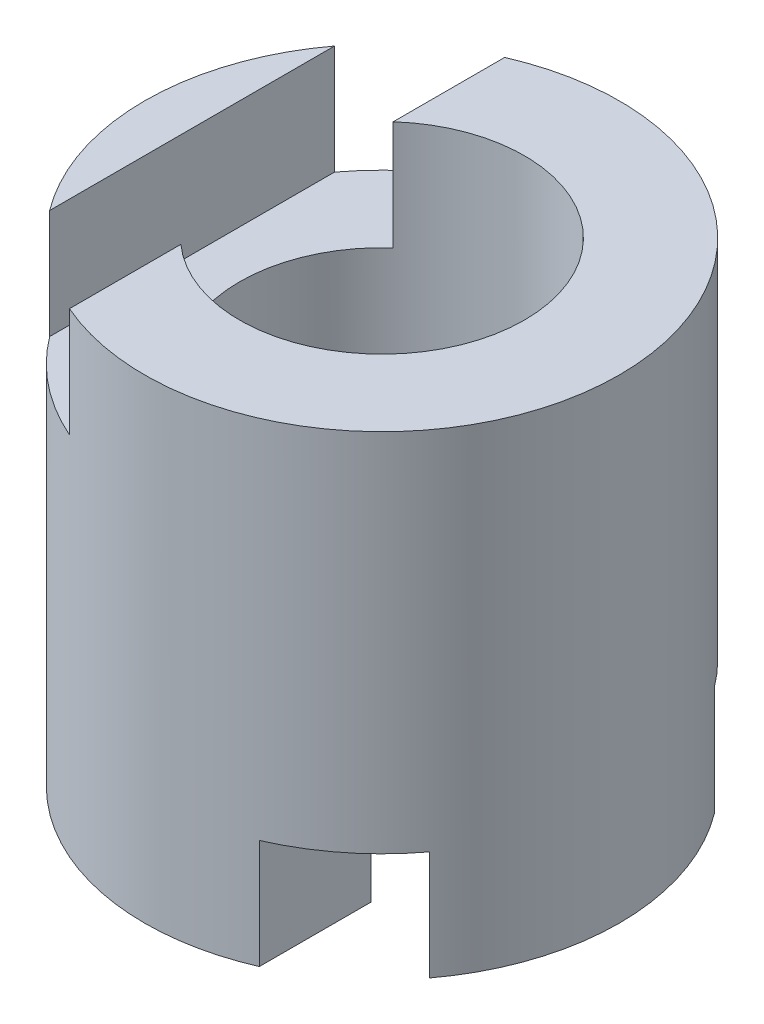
from build123d import *

# Parameters (mm, degrees)
SKETCH_1_R               = 50
SKETCH_1_R_2             = 30
EXTRUDE_1_DEPTH          = 100
CUT_EXTRUDE_1_DEPTH      = 123.474487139
CUT_EXTRUDE_1_DEPTH_BACK = 123.474487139
SKETCH_2_W               = 20
SKETCH_2_H               = 23


with BuildPart() as part:
    # Sketch 1 → Extrude 1 (new body)
    with BuildSketch(Plane(origin=(0, 0, 0), x_dir=(1, 0, 0), z_dir=(0, 1, 0))):
        with Locations(Location((0, 0, 0), (0, 0, 270))):
            Circle(SKETCH_1_R)
        with Locations(Location((0, 0, 0), (0, 0, 270))):
            Circle(SKETCH_1_R_2, mode=Mode.SUBTRACT)
    extrude(amount=-EXTRUDE_1_DEPTH)

    # Sketch 2 → Cut-Extrude 1 (cut, two sides: drawn at the far end of the back side and taken through both)
    with BuildSketch(Plane.XY.offset(-CUT_EXTRUDE_1_DEPTH_BACK)):
        with Locations((-30, -11.5)):
            Rectangle(SKETCH_2_W, SKETCH_2_H)
        with Locations((30, -88.5)):
            Rectangle(SKETCH_2_W, SKETCH_2_H)
    extrude(amount=CUT_EXTRUDE_1_DEPTH + CUT_EXTRUDE_1_DEPTH_BACK, mode=Mode.SUBTRACT)


solid = part.part
